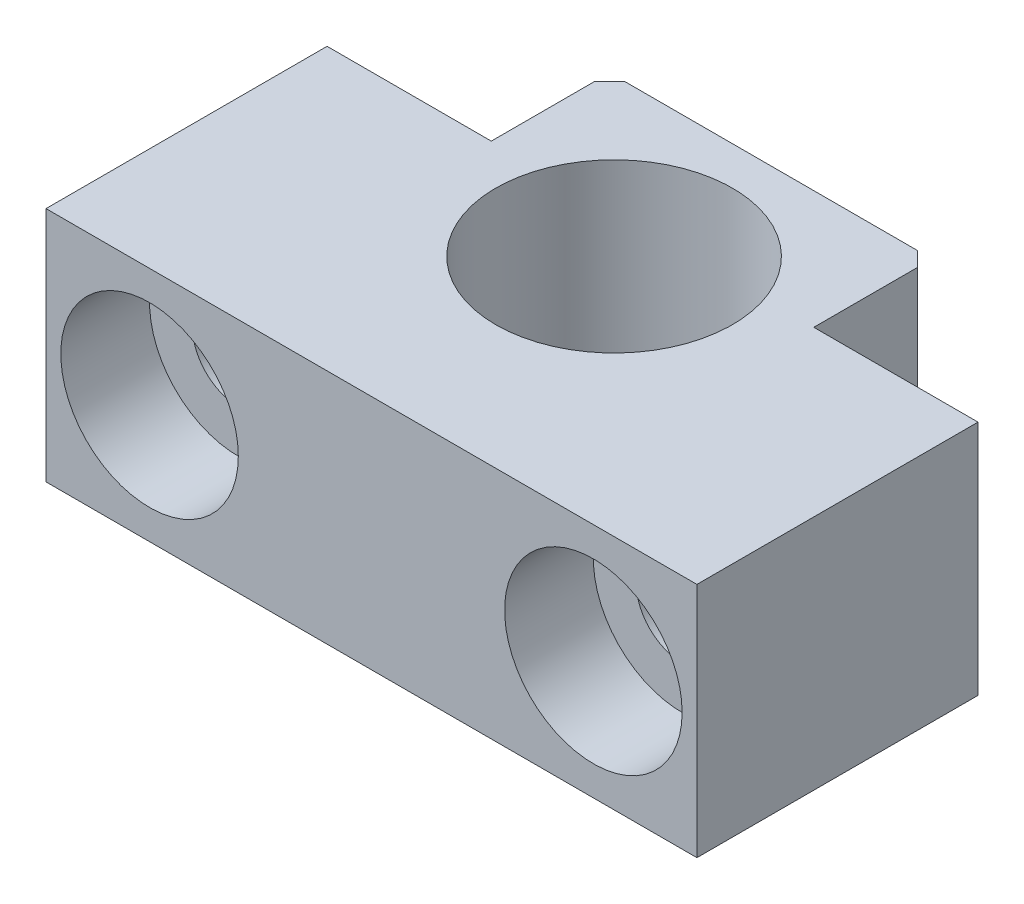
ISO-10303-21;
HEADER;
FILE_DESCRIPTION(('STEP AP214'),'2;1');
FILE_NAME('part.step','',(''),(''),'','','');
FILE_SCHEMA(('AUTOMOTIVE_DESIGN { 1 0 10303 214 1 1 1 1 }'));
ENDSEC;
DATA;
#1=APPLICATION_CONTEXT('core data for automotive mechanical design processes');
#2=APPLICATION_PROTOCOL_DEFINITION('international standard','automotive_design',2000,#1);
#3=PRODUCT_CONTEXT('',#1,'mechanical');
#4=PRODUCT('Part','Part','',(#3));
#5=PRODUCT_RELATED_PRODUCT_CATEGORY('part','',(#4));
#6=PRODUCT_DEFINITION_FORMATION('','',#4);
#7=PRODUCT_DEFINITION_CONTEXT('part definition',#1,'design');
#8=PRODUCT_DEFINITION('design','',#6,#7);
#9=PRODUCT_DEFINITION_SHAPE('','',#8);
#10=(LENGTH_UNIT() NAMED_UNIT(*) SI_UNIT(.MILLI.,.METRE.));
#11=(NAMED_UNIT(*) PLANE_ANGLE_UNIT() SI_UNIT($,.RADIAN.));
#12=(NAMED_UNIT(*) SI_UNIT($,.STERADIAN.) SOLID_ANGLE_UNIT());
#13=UNCERTAINTY_MEASURE_WITH_UNIT(LENGTH_MEASURE(1.E-05),#10,'distance_accuracy_value','');
#14=(GEOMETRIC_REPRESENTATION_CONTEXT(3) GLOBAL_UNCERTAINTY_ASSIGNED_CONTEXT((#13)) GLOBAL_UNIT_ASSIGNED_CONTEXT((#10,
#11,#12)) REPRESENTATION_CONTEXT('',''));
#15=CARTESIAN_POINT('',(0.,0.,0.));
#16=DIRECTION('',(0.,0.,1.));
#17=DIRECTION('',(1.,0.,0.));
#18=AXIS2_PLACEMENT_3D('',#15,#16,#17);
#19=CARTESIAN_POINT('',(0.,-4.,5.2));
#20=DIRECTION('',(0.,0.,1.));
#21=DIRECTION('',(1.,0.,0.));
#22=AXIS2_PLACEMENT_3D('',#19,#20,#21);
#23=PLANE('',#22);
#24=CARTESIAN_POINT('',(-7.5,0.,5.2));
#25=DIRECTION('',(0.,0.,1.));
#26=DIRECTION('',(1.,0.,0.));
#27=AXIS2_PLACEMENT_3D('',#24,#25,#26);
#28=CIRCLE('',#27,1.55);
#29=CARTESIAN_POINT('',(-5.95,0.,5.2));
#30=VERTEX_POINT('',#29);
#31=EDGE_CURVE('E19',#30,#30,#28,.F.);
#32=ORIENTED_EDGE('',*,*,#31,.T.);
#33=EDGE_LOOP('',(#32));
#34=FACE_BOUND('',#33,.T.);
#35=CARTESIAN_POINT('',(-7.5,0.,5.2));
#36=DIRECTION('',(0.,0.,1.));
#37=DIRECTION('',(1.,0.,0.));
#38=AXIS2_PLACEMENT_3D('',#35,#36,#37);
#39=CIRCLE('',#38,3.);
#40=CARTESIAN_POINT('',(-4.5,0.,5.2));
#41=VERTEX_POINT('',#40);
#42=EDGE_CURVE('E150',#41,#41,#39,.T.);
#43=ORIENTED_EDGE('',*,*,#42,.T.);
#44=EDGE_LOOP('',(#43));
#45=FACE_BOUND('',#44,.T.);
#46=ADVANCED_FACE('F16',(#34,#45),#23,.T.);
#47=CARTESIAN_POINT('',(0.,-4.,5.2));
#48=DIRECTION('',(0.,0.,1.));
#49=DIRECTION('',(1.,0.,0.));
#50=AXIS2_PLACEMENT_3D('',#47,#48,#49);
#51=PLANE('',#50);
#52=CARTESIAN_POINT('',(7.5,0.,5.2));
#53=DIRECTION('',(0.,0.,1.));
#54=DIRECTION('',(1.,0.,0.));
#55=AXIS2_PLACEMENT_3D('',#52,#53,#54);
#56=CIRCLE('',#55,1.55);
#57=CARTESIAN_POINT('',(9.05,0.,5.2));
#58=VERTEX_POINT('',#57);
#59=EDGE_CURVE('E128',#58,#58,#56,.F.);
#60=ORIENTED_EDGE('',*,*,#59,.T.);
#61=EDGE_LOOP('',(#60));
#62=FACE_BOUND('',#61,.T.);
#63=CARTESIAN_POINT('',(7.5,0.,5.2));
#64=DIRECTION('',(0.,0.,1.));
#65=DIRECTION('',(1.,0.,0.));
#66=AXIS2_PLACEMENT_3D('',#63,#64,#65);
#67=CIRCLE('',#66,3.);
#68=CARTESIAN_POINT('',(10.5,0.,5.2));
#69=VERTEX_POINT('',#68);
#70=EDGE_CURVE('E152',#69,#69,#67,.T.);
#71=ORIENTED_EDGE('',*,*,#70,.T.);
#72=EDGE_LOOP('',(#71));
#73=FACE_BOUND('',#72,.T.);
#74=ADVANCED_FACE('F164',(#62,#73),#51,.T.);
#75=CARTESIAN_POINT('',(-7.5,0.,9.55));
#76=DIRECTION('',(0.,0.,1.));
#77=DIRECTION('',(1.,0.,0.));
#78=AXIS2_PLACEMENT_3D('',#75,#76,#77);
#79=CYLINDRICAL_SURFACE('',#78,1.55);
#80=CARTESIAN_POINT('',(-7.5,0.,-1.3));
#81=DIRECTION('',(0.,0.,1.));
#82=DIRECTION('',(1.,0.,0.));
#83=AXIS2_PLACEMENT_3D('',#80,#81,#82);
#84=CIRCLE('',#83,1.55);
#85=CARTESIAN_POINT('',(-5.95,0.,-1.3));
#86=VERTEX_POINT('',#85);
#87=EDGE_CURVE('E104',#86,#86,#84,.F.);
#88=ORIENTED_EDGE('',*,*,#87,.T.);
#89=EDGE_LOOP('',(#88));
#90=FACE_BOUND('',#89,.T.);
#91=ORIENTED_EDGE('',*,*,#31,.F.);
#92=EDGE_LOOP('',(#91));
#93=FACE_BOUND('',#92,.T.);
#94=ADVANCED_FACE('F161',(#90,#93),#79,.F.);
#95=CARTESIAN_POINT('',(7.5,0.,8.2));
#96=DIRECTION('',(0.,0.,1.));
#97=DIRECTION('',(1.,0.,0.));
#98=AXIS2_PLACEMENT_3D('',#95,#96,#97);
#99=CYLINDRICAL_SURFACE('',#98,3.);
#100=ORIENTED_EDGE('',*,*,#70,.F.);
#101=EDGE_LOOP('',(#100));
#102=FACE_BOUND('',#101,.T.);
#103=CARTESIAN_POINT('',(7.5,0.,8.2));
#104=DIRECTION('',(0.,0.,1.));
#105=DIRECTION('',(1.,0.,0.));
#106=AXIS2_PLACEMENT_3D('',#103,#104,#105);
#107=CIRCLE('',#106,3.);
#108=CARTESIAN_POINT('',(10.5,0.,8.2));
#109=VERTEX_POINT('',#108);
#110=EDGE_CURVE('E143',#109,#109,#107,.F.);
#111=ORIENTED_EDGE('',*,*,#110,.F.);
#112=EDGE_LOOP('',(#111));
#113=FACE_BOUND('',#112,.T.);
#114=ADVANCED_FACE('F163',(#102,#113),#99,.F.);
#115=CARTESIAN_POINT('',(-7.5,0.,8.2));
#116=DIRECTION('',(0.,0.,1.));
#117=DIRECTION('',(1.,0.,0.));
#118=AXIS2_PLACEMENT_3D('',#115,#116,#117);
#119=CYLINDRICAL_SURFACE('',#118,3.);
#120=ORIENTED_EDGE('',*,*,#42,.F.);
#121=EDGE_LOOP('',(#120));
#122=FACE_BOUND('',#121,.T.);
#123=CARTESIAN_POINT('',(-7.5,0.,8.2));
#124=DIRECTION('',(0.,0.,1.));
#125=DIRECTION('',(1.,0.,0.));
#126=AXIS2_PLACEMENT_3D('',#123,#124,#125);
#127=CIRCLE('',#126,3.);
#128=CARTESIAN_POINT('',(-4.5,0.,8.2));
#129=VERTEX_POINT('',#128);
#130=EDGE_CURVE('E139',#129,#129,#127,.F.);
#131=ORIENTED_EDGE('',*,*,#130,.F.);
#132=EDGE_LOOP('',(#131));
#133=FACE_BOUND('',#132,.T.);
#134=ADVANCED_FACE('F172',(#122,#133),#119,.F.);
#135=CARTESIAN_POINT('',(7.5,0.,9.55));
#136=DIRECTION('',(0.,0.,1.));
#137=DIRECTION('',(1.,0.,0.));
#138=AXIS2_PLACEMENT_3D('',#135,#136,#137);
#139=CYLINDRICAL_SURFACE('',#138,1.55);
#140=CARTESIAN_POINT('',(7.5,0.,-1.3));
#141=DIRECTION('',(0.,0.,1.));
#142=DIRECTION('',(1.,0.,0.));
#143=AXIS2_PLACEMENT_3D('',#140,#141,#142);
#144=CIRCLE('',#143,1.55);
#145=CARTESIAN_POINT('',(9.05,0.,-1.3));
#146=VERTEX_POINT('',#145);
#147=EDGE_CURVE('E134',#146,#146,#144,.F.);
#148=ORIENTED_EDGE('',*,*,#147,.T.);
#149=EDGE_LOOP('',(#148));
#150=FACE_BOUND('',#149,.T.);
#151=ORIENTED_EDGE('',*,*,#59,.F.);
#152=EDGE_LOOP('',(#151));
#153=FACE_BOUND('',#152,.T.);
#154=ADVANCED_FACE('F227',(#150,#153),#139,.F.);
#155=CARTESIAN_POINT('',(4.95,-4.,-5.3));
#156=DIRECTION('',(0.707106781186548,0.,-0.707106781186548));
#157=DIRECTION('',(-0.707106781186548,0.,-0.707106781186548));
#158=AXIS2_PLACEMENT_3D('',#155,#156,#157);
#159=PLANE('',#158);
#160=DIRECTION('',(-0.707106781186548,0.,-0.707106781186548));
#161=VECTOR('',#160,1.);
#162=CARTESIAN_POINT('',(4.95,-4.,-5.3));
#163=LINE('',#162,#161);
#164=CARTESIAN_POINT('',(5.45,-4.,-4.8));
#165=VERTEX_POINT('',#164);
#166=CARTESIAN_POINT('',(4.95,-4.,-5.3));
#167=VERTEX_POINT('',#166);
#168=EDGE_CURVE('E127',#165,#167,#163,.T.);
#169=ORIENTED_EDGE('',*,*,#168,.T.);
#170=DIRECTION('',(0.,1.,0.));
#171=VECTOR('',#170,1.);
#172=CARTESIAN_POINT('',(4.95,-4.,-5.3));
#173=LINE('',#172,#171);
#174=CARTESIAN_POINT('',(4.95,4.,-5.3));
#175=VERTEX_POINT('',#174);
#176=EDGE_CURVE('E261',#175,#167,#173,.F.);
#177=ORIENTED_EDGE('',*,*,#176,.F.);
#178=DIRECTION('',(-0.707106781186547,0.,-0.707106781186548));
#179=VECTOR('',#178,1.);
#180=CARTESIAN_POINT('',(5.45,4.,-4.8));
#181=LINE('',#180,#179);
#182=CARTESIAN_POINT('',(5.45,4.,-4.8));
#183=VERTEX_POINT('',#182);
#184=EDGE_CURVE('E124',#183,#175,#181,.T.);
#185=ORIENTED_EDGE('',*,*,#184,.F.);
#186=DIRECTION('',(0.,1.,0.));
#187=VECTOR('',#186,1.);
#188=CARTESIAN_POINT('',(5.45,4.8,-4.8));
#189=LINE('',#188,#187);
#190=EDGE_CURVE('E267',#183,#165,#189,.F.);
#191=ORIENTED_EDGE('',*,*,#190,.T.);
#192=EDGE_LOOP('',(#169,#177,#185,#191));
#193=FACE_BOUND('',#192,.T.);
#194=ADVANCED_FACE('F224',(#193),#159,.T.);
#195=CARTESIAN_POINT('',(-4.95,-4.,-5.3));
#196=DIRECTION('',(0.707106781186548,0.,0.707106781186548));
#197=DIRECTION('',(0.707106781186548,0.,-0.707106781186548));
#198=AXIS2_PLACEMENT_3D('',#195,#196,#197);
#199=PLANE('',#198);
#200=DIRECTION('',(0.,1.,0.));
#201=VECTOR('',#200,1.);
#202=CARTESIAN_POINT('',(-5.45,4.8,-4.8));
#203=LINE('',#202,#201);
#204=CARTESIAN_POINT('',(-5.45,-4.,-4.8));
#205=VERTEX_POINT('',#204);
#206=CARTESIAN_POINT('',(-5.45,4.,-4.8));
#207=VERTEX_POINT('',#206);
#208=EDGE_CURVE('E256',#205,#207,#203,.T.);
#209=ORIENTED_EDGE('',*,*,#208,.T.);
#210=DIRECTION('',(-0.707106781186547,0.,0.707106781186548));
#211=VECTOR('',#210,1.);
#212=CARTESIAN_POINT('',(-4.95,4.,-5.3));
#213=LINE('',#212,#211);
#214=CARTESIAN_POINT('',(-4.95,4.,-5.3));
#215=VERTEX_POINT('',#214);
#216=EDGE_CURVE('E114',#215,#207,#213,.T.);
#217=ORIENTED_EDGE('',*,*,#216,.F.);
#218=DIRECTION('',(0.,1.,0.));
#219=VECTOR('',#218,1.);
#220=CARTESIAN_POINT('',(-4.95,-4.,-5.3));
#221=LINE('',#220,#219);
#222=CARTESIAN_POINT('',(-4.95,-4.,-5.3));
#223=VERTEX_POINT('',#222);
#224=EDGE_CURVE('E258',#223,#215,#221,.T.);
#225=ORIENTED_EDGE('',*,*,#224,.F.);
#226=DIRECTION('',(0.707106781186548,0.,-0.707106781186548));
#227=VECTOR('',#226,1.);
#228=CARTESIAN_POINT('',(-4.95,-4.,-5.3));
#229=LINE('',#228,#227);
#230=EDGE_CURVE('E34',#205,#223,#229,.T.);
#231=ORIENTED_EDGE('',*,*,#230,.F.);
#232=EDGE_LOOP('',(#209,#217,#225,#231));
#233=FACE_BOUND('',#232,.T.);
#234=ADVANCED_FACE('F220',(#233),#199,.F.);
#235=CARTESIAN_POINT('',(0.,4.,0.));
#236=DIRECTION('',(0.,1.,0.));
#237=DIRECTION('',(0.,0.,1.));
#238=AXIS2_PLACEMENT_3D('',#235,#236,#237);
#239=PLANE('',#238);
#240=CARTESIAN_POINT('',(0.,4.,0.));
#241=DIRECTION('',(0.,1.,0.));
#242=DIRECTION('',(0.,0.,1.));
#243=AXIS2_PLACEMENT_3D('',#240,#241,#242);
#244=CIRCLE('',#243,4.);
#245=CARTESIAN_POINT('',(0.,4.,4.));
#246=VERTEX_POINT('',#245);
#247=EDGE_CURVE('E130',#246,#246,#244,.F.);
#248=ORIENTED_EDGE('',*,*,#247,.T.);
#249=EDGE_LOOP('',(#248));
#250=FACE_BOUND('',#249,.T.);
#251=DIRECTION('',(0.,0.,-1.));
#252=VECTOR('',#251,1.);
#253=CARTESIAN_POINT('',(-5.45,4.,-1.3));
#254=LINE('',#253,#252);
#255=CARTESIAN_POINT('',(-5.45,4.,-1.3));
#256=VERTEX_POINT('',#255);
#257=EDGE_CURVE('E110',#207,#256,#254,.F.);
#258=ORIENTED_EDGE('',*,*,#257,.T.);
#259=DIRECTION('',(1.,0.,0.));
#260=VECTOR('',#259,1.);
#261=CARTESIAN_POINT('',(-11.,4.,-1.3));
#262=LINE('',#261,#260);
#263=CARTESIAN_POINT('',(-11.,4.,-1.3));
#264=VERTEX_POINT('',#263);
#265=EDGE_CURVE('E107',#256,#264,#262,.F.);
#266=ORIENTED_EDGE('',*,*,#265,.T.);
#267=DIRECTION('',(0.,0.,1.));
#268=VECTOR('',#267,1.);
#269=CARTESIAN_POINT('',(-11.,4.,-5.3));
#270=LINE('',#269,#268);
#271=CARTESIAN_POINT('',(-11.,4.,8.2));
#272=VERTEX_POINT('',#271);
#273=EDGE_CURVE('E95',#272,#264,#270,.F.);
#274=ORIENTED_EDGE('',*,*,#273,.F.);
#275=DIRECTION('',(1.,0.,0.));
#276=VECTOR('',#275,1.);
#277=CARTESIAN_POINT('',(-11.,4.,8.2));
#278=LINE('',#277,#276);
#279=CARTESIAN_POINT('',(11.,4.,8.2));
#280=VERTEX_POINT('',#279);
#281=EDGE_CURVE('E90',#280,#272,#278,.F.);
#282=ORIENTED_EDGE('',*,*,#281,.F.);
#283=DIRECTION('',(0.,0.,-1.));
#284=VECTOR('',#283,1.);
#285=CARTESIAN_POINT('',(11.,4.,8.2));
#286=LINE('',#285,#284);
#287=CARTESIAN_POINT('',(11.,4.,-1.3));
#288=VERTEX_POINT('',#287);
#289=EDGE_CURVE('E142',#288,#280,#286,.F.);
#290=ORIENTED_EDGE('',*,*,#289,.F.);
#291=DIRECTION('',(1.,0.,0.));
#292=VECTOR('',#291,1.);
#293=CARTESIAN_POINT('',(5.45,4.,-1.3));
#294=LINE('',#293,#292);
#295=CARTESIAN_POINT('',(5.45,4.,-1.3));
#296=VERTEX_POINT('',#295);
#297=EDGE_CURVE('E138',#288,#296,#294,.F.);
#298=ORIENTED_EDGE('',*,*,#297,.T.);
#299=DIRECTION('',(0.,0.,1.));
#300=VECTOR('',#299,1.);
#301=CARTESIAN_POINT('',(5.45,4.,-5.3));
#302=LINE('',#301,#300);
#303=EDGE_CURVE('E270',#296,#183,#302,.F.);
#304=ORIENTED_EDGE('',*,*,#303,.T.);
#305=ORIENTED_EDGE('',*,*,#184,.T.);
#306=DIRECTION('',(-1.,0.,0.));
#307=VECTOR('',#306,1.);
#308=CARTESIAN_POINT('',(11.,4.,-5.3));
#309=LINE('',#308,#307);
#310=EDGE_CURVE('E264',#215,#175,#309,.F.);
#311=ORIENTED_EDGE('',*,*,#310,.F.);
#312=ORIENTED_EDGE('',*,*,#216,.T.);
#313=EDGE_LOOP('',(#258,#266,#274,#282,#290,#298,#304,#305,#311,#312));
#314=FACE_BOUND('',#313,.T.);
#315=ADVANCED_FACE('F108',(#250,#314),#239,.T.);
#316=CARTESIAN_POINT('',(-11.,4.8,-1.3));
#317=DIRECTION('',(0.,0.,1.));
#318=DIRECTION('',(1.,0.,0.));
#319=AXIS2_PLACEMENT_3D('',#316,#317,#318);
#320=PLANE('',#319);
#321=ORIENTED_EDGE('',*,*,#87,.F.);
#322=EDGE_LOOP('',(#321));
#323=FACE_BOUND('',#322,.T.);
#324=ORIENTED_EDGE('',*,*,#265,.F.);
#325=DIRECTION('',(0.,1.,0.));
#326=VECTOR('',#325,1.);
#327=CARTESIAN_POINT('',(-5.45,4.8,-1.3));
#328=LINE('',#327,#326);
#329=CARTESIAN_POINT('',(-5.45,-4.,-1.3));
#330=VERTEX_POINT('',#329);
#331=EDGE_CURVE('E133',#256,#330,#328,.F.);
#332=ORIENTED_EDGE('',*,*,#331,.T.);
#333=DIRECTION('',(1.,0.,0.));
#334=VECTOR('',#333,1.);
#335=CARTESIAN_POINT('',(0.,-4.,-1.3));
#336=LINE('',#335,#334);
#337=CARTESIAN_POINT('',(-11.,-4.,-1.3));
#338=VERTEX_POINT('',#337);
#339=EDGE_CURVE('E118',#330,#338,#336,.F.);
#340=ORIENTED_EDGE('',*,*,#339,.T.);
#341=DIRECTION('',(0.,1.,0.));
#342=VECTOR('',#341,1.);
#343=CARTESIAN_POINT('',(-11.,-4.,-1.3));
#344=LINE('',#343,#342);
#345=EDGE_CURVE('E100',#264,#338,#344,.F.);
#346=ORIENTED_EDGE('',*,*,#345,.F.);
#347=EDGE_LOOP('',(#324,#332,#340,#346));
#348=FACE_BOUND('',#347,.T.);
#349=ADVANCED_FACE('F117',(#323,#348),#320,.F.);
#350=CARTESIAN_POINT('',(-11.,-4.,-5.3));
#351=DIRECTION('',(-1.,0.,0.));
#352=DIRECTION('',(0.,0.,1.));
#353=AXIS2_PLACEMENT_3D('',#350,#351,#352);
#354=PLANE('',#353);
#355=ORIENTED_EDGE('',*,*,#273,.T.);
#356=ORIENTED_EDGE('',*,*,#345,.T.);
#357=DIRECTION('',(0.,0.,1.));
#358=VECTOR('',#357,1.);
#359=CARTESIAN_POINT('',(-11.,-4.,0.));
#360=LINE('',#359,#358);
#361=CARTESIAN_POINT('',(-11.,-4.,8.2));
#362=VERTEX_POINT('',#361);
#363=EDGE_CURVE('E245',#338,#362,#360,.T.);
#364=ORIENTED_EDGE('',*,*,#363,.T.);
#365=DIRECTION('',(0.,1.,0.));
#366=VECTOR('',#365,1.);
#367=CARTESIAN_POINT('',(-11.,-4.,8.2));
#368=LINE('',#367,#366);
#369=EDGE_CURVE('E102',#272,#362,#368,.F.);
#370=ORIENTED_EDGE('',*,*,#369,.F.);
#371=EDGE_LOOP('',(#355,#356,#364,#370));
#372=FACE_BOUND('',#371,.T.);
#373=ADVANCED_FACE('F97',(#372),#354,.T.);
#374=CARTESIAN_POINT('',(-11.,-4.,8.2));
#375=DIRECTION('',(0.,0.,1.));
#376=DIRECTION('',(1.,0.,0.));
#377=AXIS2_PLACEMENT_3D('',#374,#375,#376);
#378=PLANE('',#377);
#379=ORIENTED_EDGE('',*,*,#130,.T.);
#380=EDGE_LOOP('',(#379));
#381=FACE_BOUND('',#380,.T.);
#382=ORIENTED_EDGE('',*,*,#110,.T.);
#383=EDGE_LOOP('',(#382));
#384=FACE_BOUND('',#383,.T.);
#385=ORIENTED_EDGE('',*,*,#369,.T.);
#386=DIRECTION('',(1.,0.,0.));
#387=VECTOR('',#386,1.);
#388=CARTESIAN_POINT('',(0.,-4.,8.2));
#389=LINE('',#388,#387);
#390=CARTESIAN_POINT('',(11.,-4.,8.2));
#391=VERTEX_POINT('',#390);
#392=EDGE_CURVE('E243',#362,#391,#389,.T.);
#393=ORIENTED_EDGE('',*,*,#392,.T.);
#394=DIRECTION('',(0.,1.,0.));
#395=VECTOR('',#394,1.);
#396=CARTESIAN_POINT('',(11.,-4.,8.2));
#397=LINE('',#396,#395);
#398=EDGE_CURVE('E279',#280,#391,#397,.F.);
#399=ORIENTED_EDGE('',*,*,#398,.F.);
#400=ORIENTED_EDGE('',*,*,#281,.T.);
#401=EDGE_LOOP('',(#385,#393,#399,#400));
#402=FACE_BOUND('',#401,.T.);
#403=ADVANCED_FACE('F208',(#381,#384,#402),#378,.T.);
#404=CARTESIAN_POINT('',(11.,-4.,8.2));
#405=DIRECTION('',(1.,0.,0.));
#406=DIRECTION('',(0.,0.,-1.));
#407=AXIS2_PLACEMENT_3D('',#404,#405,#406);
#408=PLANE('',#407);
#409=DIRECTION('',(0.,0.,1.));
#410=VECTOR('',#409,1.);
#411=CARTESIAN_POINT('',(11.,-4.,0.));
#412=LINE('',#411,#410);
#413=CARTESIAN_POINT('',(11.,-4.,-1.3));
#414=VERTEX_POINT('',#413);
#415=EDGE_CURVE('E248',#391,#414,#412,.F.);
#416=ORIENTED_EDGE('',*,*,#415,.T.);
#417=DIRECTION('',(0.,1.,0.));
#418=VECTOR('',#417,1.);
#419=CARTESIAN_POINT('',(11.,4.8,-1.3));
#420=LINE('',#419,#418);
#421=EDGE_CURVE('E276',#414,#288,#420,.T.);
#422=ORIENTED_EDGE('',*,*,#421,.T.);
#423=ORIENTED_EDGE('',*,*,#289,.T.);
#424=ORIENTED_EDGE('',*,*,#398,.T.);
#425=EDGE_LOOP('',(#416,#422,#423,#424));
#426=FACE_BOUND('',#425,.T.);
#427=ADVANCED_FACE('F204',(#426),#408,.T.);
#428=CARTESIAN_POINT('',(5.45,4.8,-1.3));
#429=DIRECTION('',(0.,0.,1.));
#430=DIRECTION('',(1.,0.,0.));
#431=AXIS2_PLACEMENT_3D('',#428,#429,#430);
#432=PLANE('',#431);
#433=ORIENTED_EDGE('',*,*,#147,.F.);
#434=EDGE_LOOP('',(#433));
#435=FACE_BOUND('',#434,.T.);
#436=ORIENTED_EDGE('',*,*,#297,.F.);
#437=ORIENTED_EDGE('',*,*,#421,.F.);
#438=DIRECTION('',(1.,0.,0.));
#439=VECTOR('',#438,1.);
#440=CARTESIAN_POINT('',(0.,-4.,-1.3));
#441=LINE('',#440,#439);
#442=CARTESIAN_POINT('',(5.45,-4.,-1.3));
#443=VERTEX_POINT('',#442);
#444=EDGE_CURVE('E285',#414,#443,#441,.F.);
#445=ORIENTED_EDGE('',*,*,#444,.T.);
#446=DIRECTION('',(0.,1.,0.));
#447=VECTOR('',#446,1.);
#448=CARTESIAN_POINT('',(5.45,4.8,-1.3));
#449=LINE('',#448,#447);
#450=EDGE_CURVE('E137',#443,#296,#449,.T.);
#451=ORIENTED_EDGE('',*,*,#450,.T.);
#452=EDGE_LOOP('',(#436,#437,#445,#451));
#453=FACE_BOUND('',#452,.T.);
#454=ADVANCED_FACE('F200',(#435,#453),#432,.F.);
#455=CARTESIAN_POINT('',(5.45,4.8,-5.3));
#456=DIRECTION('',(-1.,0.,0.));
#457=DIRECTION('',(0.,0.,1.));
#458=AXIS2_PLACEMENT_3D('',#455,#456,#457);
#459=PLANE('',#458);
#460=ORIENTED_EDGE('',*,*,#303,.F.);
#461=ORIENTED_EDGE('',*,*,#450,.F.);
#462=DIRECTION('',(0.,0.,1.));
#463=VECTOR('',#462,1.);
#464=CARTESIAN_POINT('',(5.45,-4.,0.));
#465=LINE('',#464,#463);
#466=EDGE_CURVE('E289',#443,#165,#465,.F.);
#467=ORIENTED_EDGE('',*,*,#466,.T.);
#468=ORIENTED_EDGE('',*,*,#190,.F.);
#469=EDGE_LOOP('',(#460,#461,#467,#468));
#470=FACE_BOUND('',#469,.T.);
#471=ADVANCED_FACE('F196',(#470),#459,.F.);
#472=CARTESIAN_POINT('',(11.,-4.,-5.3));
#473=DIRECTION('',(0.,0.,-1.));
#474=DIRECTION('',(-1.,0.,0.));
#475=AXIS2_PLACEMENT_3D('',#472,#473,#474);
#476=PLANE('',#475);
#477=DIRECTION('',(1.,0.,0.));
#478=VECTOR('',#477,1.);
#479=CARTESIAN_POINT('',(0.,-4.,-5.3));
#480=LINE('',#479,#478);
#481=EDGE_CURVE('E291',#167,#223,#480,.F.);
#482=ORIENTED_EDGE('',*,*,#481,.T.);
#483=ORIENTED_EDGE('',*,*,#224,.T.);
#484=ORIENTED_EDGE('',*,*,#310,.T.);
#485=ORIENTED_EDGE('',*,*,#176,.T.);
#486=EDGE_LOOP('',(#482,#483,#484,#485));
#487=FACE_BOUND('',#486,.T.);
#488=ADVANCED_FACE('F192',(#487),#476,.T.);
#489=CARTESIAN_POINT('',(-5.45,4.8,-1.3));
#490=DIRECTION('',(1.,0.,0.));
#491=DIRECTION('',(0.,0.,-1.));
#492=AXIS2_PLACEMENT_3D('',#489,#490,#491);
#493=PLANE('',#492);
#494=ORIENTED_EDGE('',*,*,#257,.F.);
#495=ORIENTED_EDGE('',*,*,#208,.F.);
#496=DIRECTION('',(0.,0.,1.));
#497=VECTOR('',#496,1.);
#498=CARTESIAN_POINT('',(-5.45,-4.,0.));
#499=LINE('',#498,#497);
#500=EDGE_CURVE('E25',#205,#330,#499,.T.);
#501=ORIENTED_EDGE('',*,*,#500,.T.);
#502=ORIENTED_EDGE('',*,*,#331,.F.);
#503=EDGE_LOOP('',(#494,#495,#501,#502));
#504=FACE_BOUND('',#503,.T.);
#505=ADVANCED_FACE('F184',(#504),#493,.F.);
#506=CARTESIAN_POINT('',(0.,-4.,0.));
#507=DIRECTION('',(0.,1.,0.));
#508=DIRECTION('',(0.,0.,1.));
#509=AXIS2_PLACEMENT_3D('',#506,#507,#508);
#510=CYLINDRICAL_SURFACE('',#509,4.);
#511=ORIENTED_EDGE('',*,*,#247,.F.);
#512=EDGE_LOOP('',(#511));
#513=FACE_BOUND('',#512,.T.);
#514=CARTESIAN_POINT('',(0.,-4.,0.));
#515=DIRECTION('',(0.,1.,0.));
#516=DIRECTION('',(0.,0.,1.));
#517=AXIS2_PLACEMENT_3D('',#514,#515,#516);
#518=CIRCLE('',#517,4.);
#519=CARTESIAN_POINT('',(0.,-4.,4.));
#520=VERTEX_POINT('',#519);
#521=EDGE_CURVE('E11',#520,#520,#518,.F.);
#522=ORIENTED_EDGE('',*,*,#521,.T.);
#523=EDGE_LOOP('',(#522));
#524=FACE_BOUND('',#523,.T.);
#525=ADVANCED_FACE('F178',(#513,#524),#510,.F.);
#526=CARTESIAN_POINT('',(0.,-4.,0.));
#527=DIRECTION('',(0.,1.,0.));
#528=DIRECTION('',(0.,0.,1.));
#529=AXIS2_PLACEMENT_3D('',#526,#527,#528);
#530=PLANE('',#529);
#531=ORIENTED_EDGE('',*,*,#521,.F.);
#532=EDGE_LOOP('',(#531));
#533=FACE_BOUND('',#532,.T.);
#534=ORIENTED_EDGE('',*,*,#230,.T.);
#535=ORIENTED_EDGE('',*,*,#481,.F.);
#536=ORIENTED_EDGE('',*,*,#168,.F.);
#537=ORIENTED_EDGE('',*,*,#466,.F.);
#538=ORIENTED_EDGE('',*,*,#444,.F.);
#539=ORIENTED_EDGE('',*,*,#415,.F.);
#540=ORIENTED_EDGE('',*,*,#392,.F.);
#541=ORIENTED_EDGE('',*,*,#363,.F.);
#542=ORIENTED_EDGE('',*,*,#339,.F.);
#543=ORIENTED_EDGE('',*,*,#500,.F.);
#544=EDGE_LOOP('',(#534,#535,#536,#537,#538,#539,#540,#541,#542,#543));
#545=FACE_BOUND('',#544,.T.);
#546=ADVANCED_FACE('F176',(#533,#545),#530,.F.);
#547=CLOSED_SHELL('',(#46,#74,#94,#114,#134,#154,#194,#234,#315,#349,#373,#403,#427,#454,#471,
#488,#505,#525,#546));
#548=MANIFOLD_SOLID_BREP('B1',#547);
#549=ADVANCED_BREP_SHAPE_REPRESENTATION('',(#18,#548),#14);
#550=SHAPE_DEFINITION_REPRESENTATION(#9,#549);
ENDSEC;
END-ISO-10303-21;
